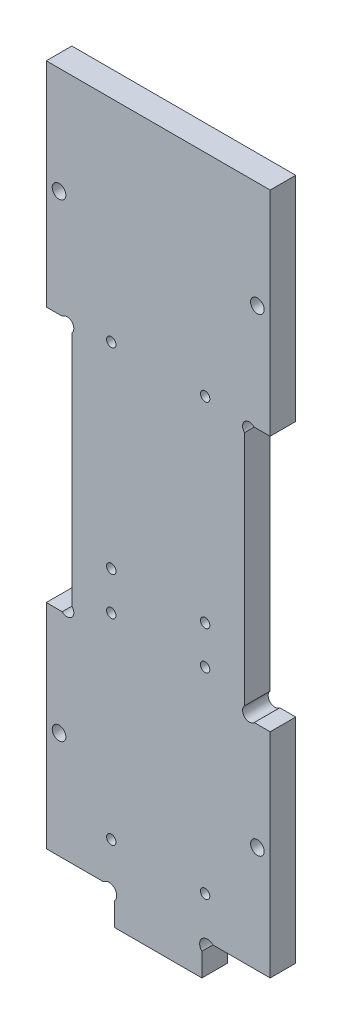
ISO-10303-21;
HEADER;
FILE_DESCRIPTION(('STEP AP214'),'2;1');
FILE_NAME('part.step','',(''),(''),'','','');
FILE_SCHEMA(('AUTOMOTIVE_DESIGN { 1 0 10303 214 1 1 1 1 }'));
ENDSEC;
DATA;
#1=APPLICATION_CONTEXT('core data for automotive mechanical design processes');
#2=APPLICATION_PROTOCOL_DEFINITION('international standard','automotive_design',2000,#1);
#3=PRODUCT_CONTEXT('',#1,'mechanical');
#4=PRODUCT('Part','Part','',(#3));
#5=PRODUCT_RELATED_PRODUCT_CATEGORY('part','',(#4));
#6=PRODUCT_DEFINITION_FORMATION('','',#4);
#7=PRODUCT_DEFINITION_CONTEXT('part definition',#1,'design');
#8=PRODUCT_DEFINITION('design','',#6,#7);
#9=PRODUCT_DEFINITION_SHAPE('','',#8);
#10=(LENGTH_UNIT() NAMED_UNIT(*) SI_UNIT(.MILLI.,.METRE.));
#11=(NAMED_UNIT(*) PLANE_ANGLE_UNIT() SI_UNIT($,.RADIAN.));
#12=(NAMED_UNIT(*) SI_UNIT($,.STERADIAN.) SOLID_ANGLE_UNIT());
#13=UNCERTAINTY_MEASURE_WITH_UNIT(LENGTH_MEASURE(1.E-05),#10,'distance_accuracy_value','');
#14=(GEOMETRIC_REPRESENTATION_CONTEXT(3) GLOBAL_UNCERTAINTY_ASSIGNED_CONTEXT((#13)) GLOBAL_UNIT_ASSIGNED_CONTEXT((#10,
#11,#12)) REPRESENTATION_CONTEXT('',''));
#15=CARTESIAN_POINT('',(0.,0.,0.));
#16=DIRECTION('',(0.,0.,1.));
#17=DIRECTION('',(1.,0.,0.));
#18=AXIS2_PLACEMENT_3D('',#15,#16,#17);
#19=CARTESIAN_POINT('',(47.6313708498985,59.1313708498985,6.));
#20=DIRECTION('',(0.,0.,1.));
#21=DIRECTION('',(1.,0.,0.));
#22=AXIS2_PLACEMENT_3D('',#19,#20,#21);
#23=PLANE('',#22);
#24=CARTESIAN_POINT('',(37.25,72.5,6.));
#25=DIRECTION('',(0.,0.,1.));
#26=DIRECTION('',(-1.,0.,0.));
#27=AXIS2_PLACEMENT_3D('',#24,#25,#26);
#28=CIRCLE('',#27,1.10000000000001);
#29=CARTESIAN_POINT('',(36.15,72.5,6.));
#30=VERTEX_POINT('',#29);
#31=EDGE_CURVE('E442',#30,#30,#28,.T.);
#32=ORIENTED_EDGE('',*,*,#31,.F.);
#33=EDGE_LOOP('',(#32));
#34=FACE_BOUND('',#33,.T.);
#35=CARTESIAN_POINT('',(15.25,118.5,6.));
#36=DIRECTION('',(0.,0.,1.));
#37=DIRECTION('',(-1.,0.,0.));
#38=AXIS2_PLACEMENT_3D('',#35,#36,#37);
#39=CIRCLE('',#38,1.1);
#40=CARTESIAN_POINT('',(14.15,118.5,6.));
#41=VERTEX_POINT('',#40);
#42=EDGE_CURVE('E454',#41,#41,#39,.T.);
#43=ORIENTED_EDGE('',*,*,#42,.F.);
#44=EDGE_LOOP('',(#43));
#45=FACE_BOUND('',#44,.T.);
#46=CARTESIAN_POINT('',(37.25,17.5,6.));
#47=DIRECTION('',(0.,0.,1.));
#48=DIRECTION('',(1.,0.,0.));
#49=AXIS2_PLACEMENT_3D('',#46,#47,#48);
#50=CIRCLE('',#49,1.1);
#51=CARTESIAN_POINT('',(38.35,17.5,6.));
#52=VERTEX_POINT('',#51);
#53=EDGE_CURVE('E466',#52,#52,#50,.T.);
#54=ORIENTED_EDGE('',*,*,#53,.F.);
#55=EDGE_LOOP('',(#54));
#56=FACE_BOUND('',#55,.T.);
#57=CARTESIAN_POINT('',(15.25,63.5,6.));
#58=DIRECTION('',(0.,0.,1.));
#59=DIRECTION('',(1.,0.,0.));
#60=AXIS2_PLACEMENT_3D('',#57,#58,#59);
#61=CIRCLE('',#60,1.1);
#62=CARTESIAN_POINT('',(16.35,63.5,6.));
#63=VERTEX_POINT('',#62);
#64=EDGE_CURVE('E478',#63,#63,#61,.T.);
#65=ORIENTED_EDGE('',*,*,#64,.F.);
#66=EDGE_LOOP('',(#65));
#67=FACE_BOUND('',#66,.T.);
#68=CARTESIAN_POINT('',(2.99999999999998,143.,6.));
#69=DIRECTION('',(0.,0.,1.));
#70=DIRECTION('',(1.,0.,0.));
#71=AXIS2_PLACEMENT_3D('',#68,#69,#70);
#72=CIRCLE('',#71,1.59999999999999);
#73=CARTESIAN_POINT('',(4.59999999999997,143.,6.));
#74=VERTEX_POINT('',#73);
#75=EDGE_CURVE('E490',#74,#74,#72,.T.);
#76=ORIENTED_EDGE('',*,*,#75,.F.);
#77=EDGE_LOOP('',(#76));
#78=FACE_BOUND('',#77,.T.);
#79=CARTESIAN_POINT('',(49.5,33.,6.));
#80=DIRECTION('',(0.,0.,1.));
#81=DIRECTION('',(1.,0.,0.));
#82=AXIS2_PLACEMENT_3D('',#79,#80,#81);
#83=CIRCLE('',#82,1.6);
#84=CARTESIAN_POINT('',(51.1,33.,6.));
#85=VERTEX_POINT('',#84);
#86=EDGE_CURVE('E202',#85,#85,#83,.T.);
#87=ORIENTED_EDGE('',*,*,#86,.F.);
#88=EDGE_LOOP('',(#87));
#89=FACE_BOUND('',#88,.T.);
#90=CARTESIAN_POINT('',(47.6313708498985,59.1313708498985,6.));
#91=DIRECTION('',(0.,0.,-1.));
#92=DIRECTION('',(1.,0.,0.));
#93=AXIS2_PLACEMENT_3D('',#90,#91,#92);
#94=CIRCLE('',#93,1.60000000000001);
#95=CARTESIAN_POINT('',(48.762741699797,58.,6.));
#96=VERTEX_POINT('',#95);
#97=CARTESIAN_POINT('',(46.5,60.262741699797,6.));
#98=VERTEX_POINT('',#97);
#99=EDGE_CURVE('E241',#96,#98,#94,.T.);
#100=ORIENTED_EDGE('',*,*,#99,.T.);
#101=DIRECTION('',(0.,1.,0.));
#102=VECTOR('',#101,1.);
#103=CARTESIAN_POINT('',(46.5,115.737258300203,6.));
#104=LINE('',#103,#102);
#105=CARTESIAN_POINT('',(46.5,115.737258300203,6.));
#106=VERTEX_POINT('',#105);
#107=EDGE_CURVE('E119',#98,#106,#104,.T.);
#108=ORIENTED_EDGE('',*,*,#107,.T.);
#109=CARTESIAN_POINT('',(47.6313708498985,116.868629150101,6.));
#110=DIRECTION('',(0.,0.,-1.));
#111=DIRECTION('',(-1.,0.,0.));
#112=AXIS2_PLACEMENT_3D('',#109,#110,#111);
#113=CIRCLE('',#112,1.60000000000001);
#114=CARTESIAN_POINT('',(48.762741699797,118.,6.));
#115=VERTEX_POINT('',#114);
#116=EDGE_CURVE('E298',#106,#115,#113,.T.);
#117=ORIENTED_EDGE('',*,*,#116,.T.);
#118=DIRECTION('',(1.,0.,0.));
#119=VECTOR('',#118,1.);
#120=CARTESIAN_POINT('',(48.762741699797,118.,6.));
#121=LINE('',#120,#119);
#122=CARTESIAN_POINT('',(52.5,118.,6.));
#123=VERTEX_POINT('',#122);
#124=EDGE_CURVE('E317',#115,#123,#121,.T.);
#125=ORIENTED_EDGE('',*,*,#124,.T.);
#126=DIRECTION('',(0.,1.,0.));
#127=VECTOR('',#126,1.);
#128=CARTESIAN_POINT('',(52.5,118.,6.));
#129=LINE('',#128,#127);
#130=CARTESIAN_POINT('',(52.5,168.,6.));
#131=VERTEX_POINT('',#130);
#132=EDGE_CURVE('E314',#123,#131,#129,.T.);
#133=ORIENTED_EDGE('',*,*,#132,.T.);
#134=DIRECTION('',(-1.,0.,0.));
#135=VECTOR('',#134,1.);
#136=CARTESIAN_POINT('',(0.,168.,6.));
#137=LINE('',#136,#135);
#138=CARTESIAN_POINT('',(0.,168.,6.));
#139=VERTEX_POINT('',#138);
#140=EDGE_CURVE('E316',#131,#139,#137,.T.);
#141=ORIENTED_EDGE('',*,*,#140,.T.);
#142=DIRECTION('',(0.,-1.,0.));
#143=VECTOR('',#142,1.);
#144=CARTESIAN_POINT('',(0.,118.,6.));
#145=LINE('',#144,#143);
#146=CARTESIAN_POINT('',(0.,118.,6.));
#147=VERTEX_POINT('',#146);
#148=EDGE_CURVE('E319',#139,#147,#145,.T.);
#149=ORIENTED_EDGE('',*,*,#148,.T.);
#150=DIRECTION('',(1.,0.,0.));
#151=VECTOR('',#150,1.);
#152=CARTESIAN_POINT('',(3.73725830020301,118.,6.));
#153=LINE('',#152,#151);
#154=CARTESIAN_POINT('',(3.73725830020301,118.,6.));
#155=VERTEX_POINT('',#154);
#156=EDGE_CURVE('E325',#147,#155,#153,.T.);
#157=ORIENTED_EDGE('',*,*,#156,.T.);
#158=CARTESIAN_POINT('',(4.86862915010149,116.868629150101,6.));
#159=DIRECTION('',(0.,0.,-1.));
#160=DIRECTION('',(1.,0.,0.));
#161=AXIS2_PLACEMENT_3D('',#158,#159,#160);
#162=CIRCLE('',#161,1.60000000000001);
#163=CARTESIAN_POINT('',(5.99999999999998,115.737258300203,6.));
#164=VERTEX_POINT('',#163);
#165=EDGE_CURVE('E327',#155,#164,#162,.T.);
#166=ORIENTED_EDGE('',*,*,#165,.T.);
#167=DIRECTION('',(0.,-1.,0.));
#168=VECTOR('',#167,1.);
#169=CARTESIAN_POINT('',(5.99999999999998,115.737258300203,6.));
#170=LINE('',#169,#168);
#171=CARTESIAN_POINT('',(5.99999999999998,60.2627416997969,6.));
#172=VERTEX_POINT('',#171);
#173=EDGE_CURVE('E329',#164,#172,#170,.T.);
#174=ORIENTED_EDGE('',*,*,#173,.T.);
#175=CARTESIAN_POINT('',(4.86862915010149,59.1313708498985,6.));
#176=DIRECTION('',(0.,0.,-1.));
#177=DIRECTION('',(-1.,0.,0.));
#178=AXIS2_PLACEMENT_3D('',#175,#176,#177);
#179=CIRCLE('',#178,1.60000000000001);
#180=CARTESIAN_POINT('',(3.73725830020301,58.,6.));
#181=VERTEX_POINT('',#180);
#182=EDGE_CURVE('E331',#172,#181,#179,.T.);
#183=ORIENTED_EDGE('',*,*,#182,.T.);
#184=DIRECTION('',(-1.,0.,0.));
#185=VECTOR('',#184,1.);
#186=CARTESIAN_POINT('',(3.73725830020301,58.,6.));
#187=LINE('',#186,#185);
#188=CARTESIAN_POINT('',(0.,58.,6.));
#189=VERTEX_POINT('',#188);
#190=EDGE_CURVE('E333',#181,#189,#187,.T.);
#191=ORIENTED_EDGE('',*,*,#190,.T.);
#192=DIRECTION('',(0.,-1.,0.));
#193=VECTOR('',#192,1.);
#194=CARTESIAN_POINT('',(0.,7.99999999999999,6.));
#195=LINE('',#194,#193);
#196=CARTESIAN_POINT('',(0.,7.99999999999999,6.));
#197=VERTEX_POINT('',#196);
#198=EDGE_CURVE('E335',#189,#197,#195,.T.);
#199=ORIENTED_EDGE('',*,*,#198,.T.);
#200=DIRECTION('',(1.,0.,0.));
#201=VECTOR('',#200,1.);
#202=CARTESIAN_POINT('',(13.4327442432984,7.99999999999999,6.));
#203=LINE('',#202,#201);
#204=CARTESIAN_POINT('',(13.4327442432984,7.99999999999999,6.));
#205=VERTEX_POINT('',#204);
#206=EDGE_CURVE('E337',#197,#205,#203,.T.);
#207=ORIENTED_EDGE('',*,*,#206,.T.);
#208=CARTESIAN_POINT('',(14.7163721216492,6.7163721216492,6.));
#209=DIRECTION('',(0.,0.,-1.));
#210=DIRECTION('',(1.,0.,0.));
#211=AXIS2_PLACEMENT_3D('',#208,#209,#210);
#212=CIRCLE('',#211,1.81532395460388);
#213=CARTESIAN_POINT('',(16.,5.43274424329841,6.));
#214=VERTEX_POINT('',#213);
#215=EDGE_CURVE('E339',#205,#214,#212,.T.);
#216=ORIENTED_EDGE('',*,*,#215,.T.);
#217=DIRECTION('',(0.,-1.,0.));
#218=VECTOR('',#217,1.);
#219=CARTESIAN_POINT('',(16.,5.43274424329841,6.));
#220=LINE('',#219,#218);
#221=CARTESIAN_POINT('',(16.,0.,6.));
#222=VERTEX_POINT('',#221);
#223=EDGE_CURVE('E341',#214,#222,#220,.T.);
#224=ORIENTED_EDGE('',*,*,#223,.T.);
#225=DIRECTION('',(1.,0.,0.));
#226=VECTOR('',#225,1.);
#227=CARTESIAN_POINT('',(16.,0.,6.));
#228=LINE('',#227,#226);
#229=CARTESIAN_POINT('',(36.5,0.,6.));
#230=VERTEX_POINT('',#229);
#231=EDGE_CURVE('E343',#222,#230,#228,.T.);
#232=ORIENTED_EDGE('',*,*,#231,.T.);
#233=DIRECTION('',(0.,1.,0.));
#234=VECTOR('',#233,1.);
#235=CARTESIAN_POINT('',(36.5,5.43274424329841,6.));
#236=LINE('',#235,#234);
#237=CARTESIAN_POINT('',(36.5,5.43274424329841,6.));
#238=VERTEX_POINT('',#237);
#239=EDGE_CURVE('E345',#230,#238,#236,.T.);
#240=ORIENTED_EDGE('',*,*,#239,.T.);
#241=CARTESIAN_POINT('',(37.7836278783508,6.7163721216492,6.));
#242=DIRECTION('',(0.,0.,-1.));
#243=DIRECTION('',(-1.,0.,0.));
#244=AXIS2_PLACEMENT_3D('',#241,#242,#243);
#245=CIRCLE('',#244,1.81532395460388);
#246=CARTESIAN_POINT('',(39.0672557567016,7.99999999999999,6.));
#247=VERTEX_POINT('',#246);
#248=EDGE_CURVE('E180',#238,#247,#245,.T.);
#249=ORIENTED_EDGE('',*,*,#248,.T.);
#250=DIRECTION('',(1.,0.,0.));
#251=VECTOR('',#250,1.);
#252=CARTESIAN_POINT('',(39.0672557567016,7.99999999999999,6.));
#253=LINE('',#252,#251);
#254=CARTESIAN_POINT('',(52.5,7.99999999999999,6.));
#255=VERTEX_POINT('',#254);
#256=EDGE_CURVE('E174',#247,#255,#253,.T.);
#257=ORIENTED_EDGE('',*,*,#256,.T.);
#258=DIRECTION('',(0.,1.,0.));
#259=VECTOR('',#258,1.);
#260=CARTESIAN_POINT('',(52.5,58.,6.));
#261=LINE('',#260,#259);
#262=CARTESIAN_POINT('',(52.5,58.,6.));
#263=VERTEX_POINT('',#262);
#264=EDGE_CURVE('E178',#255,#263,#261,.T.);
#265=ORIENTED_EDGE('',*,*,#264,.T.);
#266=DIRECTION('',(-1.,0.,0.));
#267=VECTOR('',#266,1.);
#268=CARTESIAN_POINT('',(48.762741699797,58.,6.));
#269=LINE('',#268,#267);
#270=EDGE_CURVE('E34',#263,#96,#269,.T.);
#271=ORIENTED_EDGE('',*,*,#270,.T.);
#272=EDGE_LOOP('',(#100,#108,#117,#125,#133,#141,#149,#157,#166,#174,#183,#191,#199,#207,#216,
#224,#232,#240,#249,#257,#265,#271));
#273=FACE_BOUND('',#272,.T.);
#274=CARTESIAN_POINT('',(49.5,143.,6.));
#275=DIRECTION('',(0.,0.,1.));
#276=DIRECTION('',(-1.,0.,0.));
#277=AXIS2_PLACEMENT_3D('',#274,#275,#276);
#278=CIRCLE('',#277,1.6);
#279=CARTESIAN_POINT('',(47.9,143.,6.));
#280=VERTEX_POINT('',#279);
#281=EDGE_CURVE('E496',#280,#280,#278,.T.);
#282=ORIENTED_EDGE('',*,*,#281,.F.);
#283=EDGE_LOOP('',(#282));
#284=FACE_BOUND('',#283,.T.);
#285=CARTESIAN_POINT('',(2.99999999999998,33.,6.));
#286=DIRECTION('',(0.,0.,1.));
#287=DIRECTION('',(-1.,0.,0.));
#288=AXIS2_PLACEMENT_3D('',#285,#286,#287);
#289=CIRCLE('',#288,1.6);
#290=CARTESIAN_POINT('',(1.39999999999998,33.,6.));
#291=VERTEX_POINT('',#290);
#292=EDGE_CURVE('E484',#291,#291,#289,.T.);
#293=ORIENTED_EDGE('',*,*,#292,.F.);
#294=EDGE_LOOP('',(#293));
#295=FACE_BOUND('',#294,.T.);
#296=CARTESIAN_POINT('',(37.25,63.5,6.));
#297=DIRECTION('',(0.,0.,1.));
#298=DIRECTION('',(1.,0.,0.));
#299=AXIS2_PLACEMENT_3D('',#296,#297,#298);
#300=CIRCLE('',#299,1.10000000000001);
#301=CARTESIAN_POINT('',(38.35,63.5,6.));
#302=VERTEX_POINT('',#301);
#303=EDGE_CURVE('E472',#302,#302,#300,.T.);
#304=ORIENTED_EDGE('',*,*,#303,.F.);
#305=EDGE_LOOP('',(#304));
#306=FACE_BOUND('',#305,.T.);
#307=CARTESIAN_POINT('',(15.25,17.5,6.));
#308=DIRECTION('',(0.,0.,1.));
#309=DIRECTION('',(1.,0.,0.));
#310=AXIS2_PLACEMENT_3D('',#307,#308,#309);
#311=CIRCLE('',#310,1.1);
#312=CARTESIAN_POINT('',(16.35,17.5,6.));
#313=VERTEX_POINT('',#312);
#314=EDGE_CURVE('E460',#313,#313,#311,.T.);
#315=ORIENTED_EDGE('',*,*,#314,.F.);
#316=EDGE_LOOP('',(#315));
#317=FACE_BOUND('',#316,.T.);
#318=CARTESIAN_POINT('',(37.25,118.5,6.));
#319=DIRECTION('',(0.,0.,1.));
#320=DIRECTION('',(-1.,0.,0.));
#321=AXIS2_PLACEMENT_3D('',#318,#319,#320);
#322=CIRCLE('',#321,1.10000000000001);
#323=CARTESIAN_POINT('',(36.15,118.5,6.));
#324=VERTEX_POINT('',#323);
#325=EDGE_CURVE('E448',#324,#324,#322,.T.);
#326=ORIENTED_EDGE('',*,*,#325,.F.);
#327=EDGE_LOOP('',(#326));
#328=FACE_BOUND('',#327,.T.);
#329=CARTESIAN_POINT('',(15.25,72.5,6.));
#330=DIRECTION('',(0.,0.,1.));
#331=DIRECTION('',(-1.,0.,0.));
#332=AXIS2_PLACEMENT_3D('',#329,#330,#331);
#333=CIRCLE('',#332,1.1);
#334=CARTESIAN_POINT('',(14.15,72.5,6.));
#335=VERTEX_POINT('',#334);
#336=EDGE_CURVE('E433',#335,#335,#333,.T.);
#337=ORIENTED_EDGE('',*,*,#336,.F.);
#338=EDGE_LOOP('',(#337));
#339=FACE_BOUND('',#338,.T.);
#340=ADVANCED_FACE('F17',(#34,#45,#56,#67,#78,#89,#273,#284,#295,#306,#317,#328,#339),#23,.T.);
#341=CARTESIAN_POINT('',(47.6313708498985,59.1313708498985,0.));
#342=DIRECTION('',(0.,0.,1.));
#343=DIRECTION('',(1.,0.,0.));
#344=AXIS2_PLACEMENT_3D('',#341,#342,#343);
#345=PLANE('',#344);
#346=CARTESIAN_POINT('',(37.25,72.5,0.));
#347=DIRECTION('',(0.,0.,1.));
#348=DIRECTION('',(-1.,0.,0.));
#349=AXIS2_PLACEMENT_3D('',#346,#347,#348);
#350=CIRCLE('',#349,1.10000000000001);
#351=CARTESIAN_POINT('',(36.15,72.5,0.));
#352=VERTEX_POINT('',#351);
#353=EDGE_CURVE('E439',#352,#352,#350,.T.);
#354=ORIENTED_EDGE('',*,*,#353,.T.);
#355=EDGE_LOOP('',(#354));
#356=FACE_BOUND('',#355,.T.);
#357=CARTESIAN_POINT('',(15.25,118.5,0.));
#358=DIRECTION('',(0.,0.,1.));
#359=DIRECTION('',(-1.,0.,0.));
#360=AXIS2_PLACEMENT_3D('',#357,#358,#359);
#361=CIRCLE('',#360,1.1);
#362=CARTESIAN_POINT('',(14.15,118.5,0.));
#363=VERTEX_POINT('',#362);
#364=EDGE_CURVE('E451',#363,#363,#361,.T.);
#365=ORIENTED_EDGE('',*,*,#364,.T.);
#366=EDGE_LOOP('',(#365));
#367=FACE_BOUND('',#366,.T.);
#368=CARTESIAN_POINT('',(37.25,17.5,0.));
#369=DIRECTION('',(0.,0.,1.));
#370=DIRECTION('',(1.,0.,0.));
#371=AXIS2_PLACEMENT_3D('',#368,#369,#370);
#372=CIRCLE('',#371,1.1);
#373=CARTESIAN_POINT('',(38.35,17.5,0.));
#374=VERTEX_POINT('',#373);
#375=EDGE_CURVE('E463',#374,#374,#372,.T.);
#376=ORIENTED_EDGE('',*,*,#375,.T.);
#377=EDGE_LOOP('',(#376));
#378=FACE_BOUND('',#377,.T.);
#379=CARTESIAN_POINT('',(15.25,63.5,0.));
#380=DIRECTION('',(0.,0.,1.));
#381=DIRECTION('',(1.,0.,0.));
#382=AXIS2_PLACEMENT_3D('',#379,#380,#381);
#383=CIRCLE('',#382,1.1);
#384=CARTESIAN_POINT('',(16.35,63.5,0.));
#385=VERTEX_POINT('',#384);
#386=EDGE_CURVE('E475',#385,#385,#383,.T.);
#387=ORIENTED_EDGE('',*,*,#386,.T.);
#388=EDGE_LOOP('',(#387));
#389=FACE_BOUND('',#388,.T.);
#390=CARTESIAN_POINT('',(2.99999999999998,143.,0.));
#391=DIRECTION('',(0.,0.,1.));
#392=DIRECTION('',(1.,0.,0.));
#393=AXIS2_PLACEMENT_3D('',#390,#391,#392);
#394=CIRCLE('',#393,1.59999999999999);
#395=CARTESIAN_POINT('',(4.59999999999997,143.,0.));
#396=VERTEX_POINT('',#395);
#397=EDGE_CURVE('E487',#396,#396,#394,.T.);
#398=ORIENTED_EDGE('',*,*,#397,.T.);
#399=EDGE_LOOP('',(#398));
#400=FACE_BOUND('',#399,.T.);
#401=CARTESIAN_POINT('',(49.5,33.,0.));
#402=DIRECTION('',(0.,0.,1.));
#403=DIRECTION('',(1.,0.,0.));
#404=AXIS2_PLACEMENT_3D('',#401,#402,#403);
#405=CIRCLE('',#404,1.6);
#406=CARTESIAN_POINT('',(51.1,33.,0.));
#407=VERTEX_POINT('',#406);
#408=EDGE_CURVE('E499',#407,#407,#405,.T.);
#409=ORIENTED_EDGE('',*,*,#408,.T.);
#410=EDGE_LOOP('',(#409));
#411=FACE_BOUND('',#410,.T.);
#412=CARTESIAN_POINT('',(47.6313708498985,59.1313708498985,0.));
#413=DIRECTION('',(0.,0.,-1.));
#414=DIRECTION('',(1.,0.,0.));
#415=AXIS2_PLACEMENT_3D('',#412,#413,#414);
#416=CIRCLE('',#415,1.60000000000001);
#417=CARTESIAN_POINT('',(48.762741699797,58.,0.));
#418=VERTEX_POINT('',#417);
#419=CARTESIAN_POINT('',(46.5,60.262741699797,0.));
#420=VERTEX_POINT('',#419);
#421=EDGE_CURVE('E198',#418,#420,#416,.T.);
#422=ORIENTED_EDGE('',*,*,#421,.F.);
#423=DIRECTION('',(-1.,0.,0.));
#424=VECTOR('',#423,1.);
#425=CARTESIAN_POINT('',(48.762741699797,58.,0.));
#426=LINE('',#425,#424);
#427=CARTESIAN_POINT('',(52.5,58.,0.));
#428=VERTEX_POINT('',#427);
#429=EDGE_CURVE('E111',#428,#418,#426,.T.);
#430=ORIENTED_EDGE('',*,*,#429,.F.);
#431=DIRECTION('',(0.,1.,0.));
#432=VECTOR('',#431,1.);
#433=CARTESIAN_POINT('',(52.5,58.,0.));
#434=LINE('',#433,#432);
#435=CARTESIAN_POINT('',(52.5,7.99999999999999,0.));
#436=VERTEX_POINT('',#435);
#437=EDGE_CURVE('E105',#436,#428,#434,.T.);
#438=ORIENTED_EDGE('',*,*,#437,.F.);
#439=DIRECTION('',(1.,0.,0.));
#440=VECTOR('',#439,1.);
#441=CARTESIAN_POINT('',(39.0672557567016,7.99999999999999,0.));
#442=LINE('',#441,#440);
#443=CARTESIAN_POINT('',(39.0672557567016,7.99999999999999,0.));
#444=VERTEX_POINT('',#443);
#445=EDGE_CURVE('E188',#444,#436,#442,.T.);
#446=ORIENTED_EDGE('',*,*,#445,.F.);
#447=CARTESIAN_POINT('',(37.7836278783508,6.7163721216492,0.));
#448=DIRECTION('',(0.,0.,-1.));
#449=DIRECTION('',(-1.,0.,0.));
#450=AXIS2_PLACEMENT_3D('',#447,#448,#449);
#451=CIRCLE('',#450,1.81532395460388);
#452=CARTESIAN_POINT('',(36.5,5.43274424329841,0.));
#453=VERTEX_POINT('',#452);
#454=EDGE_CURVE('E236',#453,#444,#451,.T.);
#455=ORIENTED_EDGE('',*,*,#454,.F.);
#456=DIRECTION('',(0.,1.,0.));
#457=VECTOR('',#456,1.);
#458=CARTESIAN_POINT('',(36.5,5.43274424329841,0.));
#459=LINE('',#458,#457);
#460=CARTESIAN_POINT('',(36.5,0.,0.));
#461=VERTEX_POINT('',#460);
#462=EDGE_CURVE('E234',#461,#453,#459,.T.);
#463=ORIENTED_EDGE('',*,*,#462,.F.);
#464=DIRECTION('',(1.,0.,0.));
#465=VECTOR('',#464,1.);
#466=CARTESIAN_POINT('',(16.,0.,0.));
#467=LINE('',#466,#465);
#468=CARTESIAN_POINT('',(16.,0.,0.));
#469=VERTEX_POINT('',#468);
#470=EDGE_CURVE('E232',#469,#461,#467,.T.);
#471=ORIENTED_EDGE('',*,*,#470,.F.);
#472=DIRECTION('',(0.,-1.,0.));
#473=VECTOR('',#472,1.);
#474=CARTESIAN_POINT('',(16.,5.43274424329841,0.));
#475=LINE('',#474,#473);
#476=CARTESIAN_POINT('',(16.,5.43274424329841,0.));
#477=VERTEX_POINT('',#476);
#478=EDGE_CURVE('E230',#477,#469,#475,.T.);
#479=ORIENTED_EDGE('',*,*,#478,.F.);
#480=CARTESIAN_POINT('',(14.7163721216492,6.7163721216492,0.));
#481=DIRECTION('',(0.,0.,-1.));
#482=DIRECTION('',(1.,0.,0.));
#483=AXIS2_PLACEMENT_3D('',#480,#481,#482);
#484=CIRCLE('',#483,1.81532395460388);
#485=CARTESIAN_POINT('',(13.4327442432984,7.99999999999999,0.));
#486=VERTEX_POINT('',#485);
#487=EDGE_CURVE('E228',#486,#477,#484,.T.);
#488=ORIENTED_EDGE('',*,*,#487,.F.);
#489=DIRECTION('',(1.,0.,0.));
#490=VECTOR('',#489,1.);
#491=CARTESIAN_POINT('',(13.4327442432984,7.99999999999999,0.));
#492=LINE('',#491,#490);
#493=CARTESIAN_POINT('',(0.,7.99999999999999,0.));
#494=VERTEX_POINT('',#493);
#495=EDGE_CURVE('E226',#494,#486,#492,.T.);
#496=ORIENTED_EDGE('',*,*,#495,.F.);
#497=DIRECTION('',(0.,-1.,0.));
#498=VECTOR('',#497,1.);
#499=CARTESIAN_POINT('',(0.,7.99999999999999,0.));
#500=LINE('',#499,#498);
#501=CARTESIAN_POINT('',(0.,58.,0.));
#502=VERTEX_POINT('',#501);
#503=EDGE_CURVE('E224',#502,#494,#500,.T.);
#504=ORIENTED_EDGE('',*,*,#503,.F.);
#505=DIRECTION('',(-1.,0.,0.));
#506=VECTOR('',#505,1.);
#507=CARTESIAN_POINT('',(3.73725830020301,58.,0.));
#508=LINE('',#507,#506);
#509=CARTESIAN_POINT('',(3.73725830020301,58.,0.));
#510=VERTEX_POINT('',#509);
#511=EDGE_CURVE('E222',#510,#502,#508,.T.);
#512=ORIENTED_EDGE('',*,*,#511,.F.);
#513=CARTESIAN_POINT('',(4.86862915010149,59.1313708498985,0.));
#514=DIRECTION('',(0.,0.,-1.));
#515=DIRECTION('',(-1.,0.,0.));
#516=AXIS2_PLACEMENT_3D('',#513,#514,#515);
#517=CIRCLE('',#516,1.60000000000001);
#518=CARTESIAN_POINT('',(5.99999999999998,60.2627416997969,0.));
#519=VERTEX_POINT('',#518);
#520=EDGE_CURVE('E220',#519,#510,#517,.T.);
#521=ORIENTED_EDGE('',*,*,#520,.F.);
#522=DIRECTION('',(0.,-1.,0.));
#523=VECTOR('',#522,1.);
#524=CARTESIAN_POINT('',(5.99999999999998,115.737258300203,0.));
#525=LINE('',#524,#523);
#526=CARTESIAN_POINT('',(5.99999999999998,115.737258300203,0.));
#527=VERTEX_POINT('',#526);
#528=EDGE_CURVE('E218',#527,#519,#525,.T.);
#529=ORIENTED_EDGE('',*,*,#528,.F.);
#530=CARTESIAN_POINT('',(4.86862915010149,116.868629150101,0.));
#531=DIRECTION('',(0.,0.,-1.));
#532=DIRECTION('',(1.,0.,0.));
#533=AXIS2_PLACEMENT_3D('',#530,#531,#532);
#534=CIRCLE('',#533,1.60000000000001);
#535=CARTESIAN_POINT('',(3.73725830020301,118.,0.));
#536=VERTEX_POINT('',#535);
#537=EDGE_CURVE('E216',#536,#527,#534,.T.);
#538=ORIENTED_EDGE('',*,*,#537,.F.);
#539=DIRECTION('',(1.,0.,0.));
#540=VECTOR('',#539,1.);
#541=CARTESIAN_POINT('',(3.73725830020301,118.,0.));
#542=LINE('',#541,#540);
#543=CARTESIAN_POINT('',(0.,118.,0.));
#544=VERTEX_POINT('',#543);
#545=EDGE_CURVE('E214',#544,#536,#542,.T.);
#546=ORIENTED_EDGE('',*,*,#545,.F.);
#547=DIRECTION('',(0.,-1.,0.));
#548=VECTOR('',#547,1.);
#549=CARTESIAN_POINT('',(0.,118.,0.));
#550=LINE('',#549,#548);
#551=CARTESIAN_POINT('',(0.,168.,0.));
#552=VERTEX_POINT('',#551);
#553=EDGE_CURVE('E212',#552,#544,#550,.T.);
#554=ORIENTED_EDGE('',*,*,#553,.F.);
#555=DIRECTION('',(-1.,0.,0.));
#556=VECTOR('',#555,1.);
#557=CARTESIAN_POINT('',(0.,168.,0.));
#558=LINE('',#557,#556);
#559=CARTESIAN_POINT('',(52.5,168.,0.));
#560=VERTEX_POINT('',#559);
#561=EDGE_CURVE('E210',#560,#552,#558,.T.);
#562=ORIENTED_EDGE('',*,*,#561,.F.);
#563=DIRECTION('',(0.,1.,0.));
#564=VECTOR('',#563,1.);
#565=CARTESIAN_POINT('',(52.5,118.,0.));
#566=LINE('',#565,#564);
#567=CARTESIAN_POINT('',(52.5,118.,0.));
#568=VERTEX_POINT('',#567);
#569=EDGE_CURVE('E208',#568,#560,#566,.T.);
#570=ORIENTED_EDGE('',*,*,#569,.F.);
#571=DIRECTION('',(1.,0.,0.));
#572=VECTOR('',#571,1.);
#573=CARTESIAN_POINT('',(48.762741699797,118.,0.));
#574=LINE('',#573,#572);
#575=CARTESIAN_POINT('',(48.762741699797,118.,0.));
#576=VERTEX_POINT('',#575);
#577=EDGE_CURVE('E206',#576,#568,#574,.T.);
#578=ORIENTED_EDGE('',*,*,#577,.F.);
#579=CARTESIAN_POINT('',(47.6313708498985,116.868629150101,0.));
#580=DIRECTION('',(0.,0.,-1.));
#581=DIRECTION('',(-1.,0.,0.));
#582=AXIS2_PLACEMENT_3D('',#579,#580,#581);
#583=CIRCLE('',#582,1.60000000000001);
#584=CARTESIAN_POINT('',(46.5,115.737258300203,0.));
#585=VERTEX_POINT('',#584);
#586=EDGE_CURVE('E204',#585,#576,#583,.T.);
#587=ORIENTED_EDGE('',*,*,#586,.F.);
#588=DIRECTION('',(0.,1.,0.));
#589=VECTOR('',#588,1.);
#590=CARTESIAN_POINT('',(46.5,115.737258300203,0.));
#591=LINE('',#590,#589);
#592=EDGE_CURVE('E201',#420,#585,#591,.T.);
#593=ORIENTED_EDGE('',*,*,#592,.F.);
#594=EDGE_LOOP('',(#422,#430,#438,#446,#455,#463,#471,#479,#488,#496,#504,#512,#521,#529,#538,
#546,#554,#562,#570,#578,#587,#593));
#595=FACE_BOUND('',#594,.T.);
#596=CARTESIAN_POINT('',(49.5,143.,0.));
#597=DIRECTION('',(0.,0.,1.));
#598=DIRECTION('',(-1.,0.,0.));
#599=AXIS2_PLACEMENT_3D('',#596,#597,#598);
#600=CIRCLE('',#599,1.6);
#601=CARTESIAN_POINT('',(47.9,143.,0.));
#602=VERTEX_POINT('',#601);
#603=EDGE_CURVE('E493',#602,#602,#600,.T.);
#604=ORIENTED_EDGE('',*,*,#603,.T.);
#605=EDGE_LOOP('',(#604));
#606=FACE_BOUND('',#605,.T.);
#607=CARTESIAN_POINT('',(2.99999999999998,33.,0.));
#608=DIRECTION('',(0.,0.,1.));
#609=DIRECTION('',(-1.,0.,0.));
#610=AXIS2_PLACEMENT_3D('',#607,#608,#609);
#611=CIRCLE('',#610,1.6);
#612=CARTESIAN_POINT('',(1.39999999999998,33.,0.));
#613=VERTEX_POINT('',#612);
#614=EDGE_CURVE('E481',#613,#613,#611,.T.);
#615=ORIENTED_EDGE('',*,*,#614,.T.);
#616=EDGE_LOOP('',(#615));
#617=FACE_BOUND('',#616,.T.);
#618=CARTESIAN_POINT('',(37.25,63.5,0.));
#619=DIRECTION('',(0.,0.,1.));
#620=DIRECTION('',(1.,0.,0.));
#621=AXIS2_PLACEMENT_3D('',#618,#619,#620);
#622=CIRCLE('',#621,1.10000000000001);
#623=CARTESIAN_POINT('',(38.35,63.5,0.));
#624=VERTEX_POINT('',#623);
#625=EDGE_CURVE('E469',#624,#624,#622,.T.);
#626=ORIENTED_EDGE('',*,*,#625,.T.);
#627=EDGE_LOOP('',(#626));
#628=FACE_BOUND('',#627,.T.);
#629=CARTESIAN_POINT('',(15.25,17.5,0.));
#630=DIRECTION('',(0.,0.,1.));
#631=DIRECTION('',(1.,0.,0.));
#632=AXIS2_PLACEMENT_3D('',#629,#630,#631);
#633=CIRCLE('',#632,1.1);
#634=CARTESIAN_POINT('',(16.35,17.5,0.));
#635=VERTEX_POINT('',#634);
#636=EDGE_CURVE('E457',#635,#635,#633,.T.);
#637=ORIENTED_EDGE('',*,*,#636,.T.);
#638=EDGE_LOOP('',(#637));
#639=FACE_BOUND('',#638,.T.);
#640=CARTESIAN_POINT('',(37.25,118.5,0.));
#641=DIRECTION('',(0.,0.,1.));
#642=DIRECTION('',(-1.,0.,0.));
#643=AXIS2_PLACEMENT_3D('',#640,#641,#642);
#644=CIRCLE('',#643,1.10000000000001);
#645=CARTESIAN_POINT('',(36.15,118.5,0.));
#646=VERTEX_POINT('',#645);
#647=EDGE_CURVE('E445',#646,#646,#644,.T.);
#648=ORIENTED_EDGE('',*,*,#647,.T.);
#649=EDGE_LOOP('',(#648));
#650=FACE_BOUND('',#649,.T.);
#651=CARTESIAN_POINT('',(15.25,72.5,0.));
#652=DIRECTION('',(0.,0.,1.));
#653=DIRECTION('',(-1.,0.,0.));
#654=AXIS2_PLACEMENT_3D('',#651,#652,#653);
#655=CIRCLE('',#654,1.1);
#656=CARTESIAN_POINT('',(14.15,72.5,0.));
#657=VERTEX_POINT('',#656);
#658=EDGE_CURVE('E436',#657,#657,#655,.T.);
#659=ORIENTED_EDGE('',*,*,#658,.T.);
#660=EDGE_LOOP('',(#659));
#661=FACE_BOUND('',#660,.T.);
#662=ADVANCED_FACE('F302',(#356,#367,#378,#389,#400,#411,#595,#606,#617,#628,#639,#650,#661),
#345,.F.);
#663=CARTESIAN_POINT('',(47.6313708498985,59.1313708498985,6.));
#664=DIRECTION('',(0.,0.,-1.));
#665=DIRECTION('',(-1.,0.,0.));
#666=AXIS2_PLACEMENT_3D('',#663,#664,#665);
#667=CYLINDRICAL_SURFACE('',#666,1.60000000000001);
#668=ORIENTED_EDGE('',*,*,#421,.T.);
#669=DIRECTION('',(0.,0.,-1.));
#670=VECTOR('',#669,1.);
#671=CARTESIAN_POINT('',(46.5,60.262741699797,6.));
#672=LINE('',#671,#670);
#673=EDGE_CURVE('E11',#98,#420,#672,.T.);
#674=ORIENTED_EDGE('',*,*,#673,.F.);
#675=ORIENTED_EDGE('',*,*,#99,.F.);
#676=DIRECTION('',(0.,0.,-1.));
#677=VECTOR('',#676,1.);
#678=CARTESIAN_POINT('',(48.762741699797,58.,6.));
#679=LINE('',#678,#677);
#680=EDGE_CURVE('E194',#96,#418,#679,.T.);
#681=ORIENTED_EDGE('',*,*,#680,.T.);
#682=EDGE_LOOP('',(#668,#674,#675,#681));
#683=FACE_BOUND('',#682,.T.);
#684=ADVANCED_FACE('F19',(#683),#667,.F.);
#685=CARTESIAN_POINT('',(46.5,115.737258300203,6.));
#686=DIRECTION('',(-1.,0.,0.));
#687=DIRECTION('',(0.,-1.,0.));
#688=AXIS2_PLACEMENT_3D('',#685,#686,#687);
#689=PLANE('',#688);
#690=ORIENTED_EDGE('',*,*,#592,.T.);
#691=DIRECTION('',(0.,0.,-1.));
#692=VECTOR('',#691,1.);
#693=CARTESIAN_POINT('',(46.5,115.737258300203,6.));
#694=LINE('',#693,#692);
#695=EDGE_CURVE('E26',#106,#585,#694,.T.);
#696=ORIENTED_EDGE('',*,*,#695,.F.);
#697=ORIENTED_EDGE('',*,*,#107,.F.);
#698=ORIENTED_EDGE('',*,*,#673,.T.);
#699=EDGE_LOOP('',(#690,#696,#697,#698));
#700=FACE_BOUND('',#699,.T.);
#701=ADVANCED_FACE('F795',(#700),#689,.F.);
#702=CARTESIAN_POINT('',(47.6313708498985,116.868629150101,6.));
#703=DIRECTION('',(0.,0.,-1.));
#704=DIRECTION('',(-1.,0.,0.));
#705=AXIS2_PLACEMENT_3D('',#702,#703,#704);
#706=CYLINDRICAL_SURFACE('',#705,1.60000000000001);
#707=ORIENTED_EDGE('',*,*,#586,.T.);
#708=DIRECTION('',(0.,0.,-1.));
#709=VECTOR('',#708,1.);
#710=CARTESIAN_POINT('',(48.762741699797,118.,6.));
#711=LINE('',#710,#709);
#712=EDGE_CURVE('E290',#115,#576,#711,.T.);
#713=ORIENTED_EDGE('',*,*,#712,.F.);
#714=ORIENTED_EDGE('',*,*,#116,.F.);
#715=ORIENTED_EDGE('',*,*,#695,.T.);
#716=EDGE_LOOP('',(#707,#713,#714,#715));
#717=FACE_BOUND('',#716,.T.);
#718=ADVANCED_FACE('F296',(#717),#706,.F.);
#719=CARTESIAN_POINT('',(48.762741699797,118.,6.));
#720=DIRECTION('',(0.,1.,0.));
#721=DIRECTION('',(0.,0.,1.));
#722=AXIS2_PLACEMENT_3D('',#719,#720,#721);
#723=PLANE('',#722);
#724=ORIENTED_EDGE('',*,*,#577,.T.);
#725=DIRECTION('',(0.,0.,-1.));
#726=VECTOR('',#725,1.);
#727=CARTESIAN_POINT('',(52.5,118.,6.));
#728=LINE('',#727,#726);
#729=EDGE_CURVE('E287',#123,#568,#728,.T.);
#730=ORIENTED_EDGE('',*,*,#729,.F.);
#731=ORIENTED_EDGE('',*,*,#124,.F.);
#732=ORIENTED_EDGE('',*,*,#712,.T.);
#733=EDGE_LOOP('',(#724,#730,#731,#732));
#734=FACE_BOUND('',#733,.T.);
#735=ADVANCED_FACE('F308',(#734),#723,.F.);
#736=CARTESIAN_POINT('',(52.5,118.,6.));
#737=DIRECTION('',(-1.,0.,0.));
#738=DIRECTION('',(0.,-1.,0.));
#739=AXIS2_PLACEMENT_3D('',#736,#737,#738);
#740=PLANE('',#739);
#741=ORIENTED_EDGE('',*,*,#569,.T.);
#742=DIRECTION('',(0.,0.,-1.));
#743=VECTOR('',#742,1.);
#744=CARTESIAN_POINT('',(52.5,168.,6.));
#745=LINE('',#744,#743);
#746=EDGE_CURVE('E284',#131,#560,#745,.T.);
#747=ORIENTED_EDGE('',*,*,#746,.F.);
#748=ORIENTED_EDGE('',*,*,#132,.F.);
#749=ORIENTED_EDGE('',*,*,#729,.T.);
#750=EDGE_LOOP('',(#741,#747,#748,#749));
#751=FACE_BOUND('',#750,.T.);
#752=ADVANCED_FACE('F312',(#751),#740,.F.);
#753=CARTESIAN_POINT('',(0.,168.,6.));
#754=DIRECTION('',(0.,-1.,0.));
#755=DIRECTION('',(0.,0.,-1.));
#756=AXIS2_PLACEMENT_3D('',#753,#754,#755);
#757=PLANE('',#756);
#758=ORIENTED_EDGE('',*,*,#561,.T.);
#759=DIRECTION('',(0.,0.,-1.));
#760=VECTOR('',#759,1.);
#761=CARTESIAN_POINT('',(0.,168.,6.));
#762=LINE('',#761,#760);
#763=EDGE_CURVE('E281',#139,#552,#762,.T.);
#764=ORIENTED_EDGE('',*,*,#763,.F.);
#765=ORIENTED_EDGE('',*,*,#140,.F.);
#766=ORIENTED_EDGE('',*,*,#746,.T.);
#767=EDGE_LOOP('',(#758,#764,#765,#766));
#768=FACE_BOUND('',#767,.T.);
#769=ADVANCED_FACE('F760',(#768),#757,.F.);
#770=CARTESIAN_POINT('',(0.,118.,6.));
#771=DIRECTION('',(1.,0.,0.));
#772=DIRECTION('',(0.,1.,0.));
#773=AXIS2_PLACEMENT_3D('',#770,#771,#772);
#774=PLANE('',#773);
#775=ORIENTED_EDGE('',*,*,#553,.T.);
#776=DIRECTION('',(0.,0.,-1.));
#777=VECTOR('',#776,1.);
#778=CARTESIAN_POINT('',(0.,118.,6.));
#779=LINE('',#778,#777);
#780=EDGE_CURVE('E278',#147,#544,#779,.T.);
#781=ORIENTED_EDGE('',*,*,#780,.F.);
#782=ORIENTED_EDGE('',*,*,#148,.F.);
#783=ORIENTED_EDGE('',*,*,#763,.T.);
#784=EDGE_LOOP('',(#775,#781,#782,#783));
#785=FACE_BOUND('',#784,.T.);
#786=ADVANCED_FACE('F750',(#785),#774,.F.);
#787=CARTESIAN_POINT('',(3.73725830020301,118.,6.));
#788=DIRECTION('',(0.,1.,0.));
#789=DIRECTION('',(0.,0.,1.));
#790=AXIS2_PLACEMENT_3D('',#787,#788,#789);
#791=PLANE('',#790);
#792=ORIENTED_EDGE('',*,*,#545,.T.);
#793=DIRECTION('',(0.,0.,-1.));
#794=VECTOR('',#793,1.);
#795=CARTESIAN_POINT('',(3.73725830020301,118.,6.));
#796=LINE('',#795,#794);
#797=EDGE_CURVE('E275',#155,#536,#796,.T.);
#798=ORIENTED_EDGE('',*,*,#797,.F.);
#799=ORIENTED_EDGE('',*,*,#156,.F.);
#800=ORIENTED_EDGE('',*,*,#780,.T.);
#801=EDGE_LOOP('',(#792,#798,#799,#800));
#802=FACE_BOUND('',#801,.T.);
#803=ADVANCED_FACE('F740',(#802),#791,.F.);
#804=CARTESIAN_POINT('',(4.86862915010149,116.868629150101,6.));
#805=DIRECTION('',(0.,0.,-1.));
#806=DIRECTION('',(-1.,0.,0.));
#807=AXIS2_PLACEMENT_3D('',#804,#805,#806);
#808=CYLINDRICAL_SURFACE('',#807,1.60000000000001);
#809=ORIENTED_EDGE('',*,*,#537,.T.);
#810=DIRECTION('',(0.,0.,-1.));
#811=VECTOR('',#810,1.);
#812=CARTESIAN_POINT('',(5.99999999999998,115.737258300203,6.));
#813=LINE('',#812,#811);
#814=EDGE_CURVE('E272',#164,#527,#813,.T.);
#815=ORIENTED_EDGE('',*,*,#814,.F.);
#816=ORIENTED_EDGE('',*,*,#165,.F.);
#817=ORIENTED_EDGE('',*,*,#797,.T.);
#818=EDGE_LOOP('',(#809,#815,#816,#817));
#819=FACE_BOUND('',#818,.T.);
#820=ADVANCED_FACE('F730',(#819),#808,.F.);
#821=CARTESIAN_POINT('',(5.99999999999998,115.737258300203,6.));
#822=DIRECTION('',(1.,0.,0.));
#823=DIRECTION('',(0.,0.,-1.));
#824=AXIS2_PLACEMENT_3D('',#821,#822,#823);
#825=PLANE('',#824);
#826=ORIENTED_EDGE('',*,*,#528,.T.);
#827=DIRECTION('',(0.,0.,-1.));
#828=VECTOR('',#827,1.);
#829=CARTESIAN_POINT('',(5.99999999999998,60.2627416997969,6.));
#830=LINE('',#829,#828);
#831=EDGE_CURVE('E269',#172,#519,#830,.T.);
#832=ORIENTED_EDGE('',*,*,#831,.F.);
#833=ORIENTED_EDGE('',*,*,#173,.F.);
#834=ORIENTED_EDGE('',*,*,#814,.T.);
#835=EDGE_LOOP('',(#826,#832,#833,#834));
#836=FACE_BOUND('',#835,.T.);
#837=ADVANCED_FACE('F720',(#836),#825,.F.);
#838=CARTESIAN_POINT('',(4.86862915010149,59.1313708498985,6.));
#839=DIRECTION('',(0.,0.,-1.));
#840=DIRECTION('',(-1.,0.,0.));
#841=AXIS2_PLACEMENT_3D('',#838,#839,#840);
#842=CYLINDRICAL_SURFACE('',#841,1.60000000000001);
#843=ORIENTED_EDGE('',*,*,#520,.T.);
#844=DIRECTION('',(0.,0.,-1.));
#845=VECTOR('',#844,1.);
#846=CARTESIAN_POINT('',(3.73725830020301,58.,6.));
#847=LINE('',#846,#845);
#848=EDGE_CURVE('E266',#181,#510,#847,.T.);
#849=ORIENTED_EDGE('',*,*,#848,.F.);
#850=ORIENTED_EDGE('',*,*,#182,.F.);
#851=ORIENTED_EDGE('',*,*,#831,.T.);
#852=EDGE_LOOP('',(#843,#849,#850,#851));
#853=FACE_BOUND('',#852,.T.);
#854=ADVANCED_FACE('F710',(#853),#842,.F.);
#855=CARTESIAN_POINT('',(3.73725830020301,58.,6.));
#856=DIRECTION('',(0.,-1.,0.));
#857=DIRECTION('',(0.,0.,-1.));
#858=AXIS2_PLACEMENT_3D('',#855,#856,#857);
#859=PLANE('',#858);
#860=ORIENTED_EDGE('',*,*,#511,.T.);
#861=DIRECTION('',(0.,0.,-1.));
#862=VECTOR('',#861,1.);
#863=CARTESIAN_POINT('',(0.,58.,6.));
#864=LINE('',#863,#862);
#865=EDGE_CURVE('E263',#189,#502,#864,.T.);
#866=ORIENTED_EDGE('',*,*,#865,.F.);
#867=ORIENTED_EDGE('',*,*,#190,.F.);
#868=ORIENTED_EDGE('',*,*,#848,.T.);
#869=EDGE_LOOP('',(#860,#866,#867,#868));
#870=FACE_BOUND('',#869,.T.);
#871=ADVANCED_FACE('F700',(#870),#859,.F.);
#872=CARTESIAN_POINT('',(0.,7.99999999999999,6.));
#873=DIRECTION('',(1.,0.,0.));
#874=DIRECTION('',(0.,1.,0.));
#875=AXIS2_PLACEMENT_3D('',#872,#873,#874);
#876=PLANE('',#875);
#877=ORIENTED_EDGE('',*,*,#503,.T.);
#878=DIRECTION('',(0.,0.,-1.));
#879=VECTOR('',#878,1.);
#880=CARTESIAN_POINT('',(0.,7.99999999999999,6.));
#881=LINE('',#880,#879);
#882=EDGE_CURVE('E260',#197,#494,#881,.T.);
#883=ORIENTED_EDGE('',*,*,#882,.F.);
#884=ORIENTED_EDGE('',*,*,#198,.F.);
#885=ORIENTED_EDGE('',*,*,#865,.T.);
#886=EDGE_LOOP('',(#877,#883,#884,#885));
#887=FACE_BOUND('',#886,.T.);
#888=ADVANCED_FACE('F690',(#887),#876,.F.);
#889=CARTESIAN_POINT('',(13.4327442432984,7.99999999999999,6.));
#890=DIRECTION('',(0.,1.,0.));
#891=DIRECTION('',(0.,0.,1.));
#892=AXIS2_PLACEMENT_3D('',#889,#890,#891);
#893=PLANE('',#892);
#894=ORIENTED_EDGE('',*,*,#495,.T.);
#895=DIRECTION('',(0.,0.,-1.));
#896=VECTOR('',#895,1.);
#897=CARTESIAN_POINT('',(13.4327442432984,7.99999999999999,6.));
#898=LINE('',#897,#896);
#899=EDGE_CURVE('E257',#205,#486,#898,.T.);
#900=ORIENTED_EDGE('',*,*,#899,.F.);
#901=ORIENTED_EDGE('',*,*,#206,.F.);
#902=ORIENTED_EDGE('',*,*,#882,.T.);
#903=EDGE_LOOP('',(#894,#900,#901,#902));
#904=FACE_BOUND('',#903,.T.);
#905=ADVANCED_FACE('F680',(#904),#893,.F.);
#906=CARTESIAN_POINT('',(14.7163721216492,6.7163721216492,6.));
#907=DIRECTION('',(0.,0.,-1.));
#908=DIRECTION('',(-1.,0.,0.));
#909=AXIS2_PLACEMENT_3D('',#906,#907,#908);
#910=CYLINDRICAL_SURFACE('',#909,1.81532395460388);
#911=ORIENTED_EDGE('',*,*,#487,.T.);
#912=DIRECTION('',(0.,0.,-1.));
#913=VECTOR('',#912,1.);
#914=CARTESIAN_POINT('',(16.,5.43274424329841,6.));
#915=LINE('',#914,#913);
#916=EDGE_CURVE('E254',#214,#477,#915,.T.);
#917=ORIENTED_EDGE('',*,*,#916,.F.);
#918=ORIENTED_EDGE('',*,*,#215,.F.);
#919=ORIENTED_EDGE('',*,*,#899,.T.);
#920=EDGE_LOOP('',(#911,#917,#918,#919));
#921=FACE_BOUND('',#920,.T.);
#922=ADVANCED_FACE('F670',(#921),#910,.F.);
#923=CARTESIAN_POINT('',(16.,5.43274424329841,6.));
#924=DIRECTION('',(1.,0.,0.));
#925=DIRECTION('',(0.,0.,-1.));
#926=AXIS2_PLACEMENT_3D('',#923,#924,#925);
#927=PLANE('',#926);
#928=ORIENTED_EDGE('',*,*,#478,.T.);
#929=DIRECTION('',(0.,0.,-1.));
#930=VECTOR('',#929,1.);
#931=CARTESIAN_POINT('',(16.,0.,6.));
#932=LINE('',#931,#930);
#933=EDGE_CURVE('E251',#222,#469,#932,.T.);
#934=ORIENTED_EDGE('',*,*,#933,.F.);
#935=ORIENTED_EDGE('',*,*,#223,.F.);
#936=ORIENTED_EDGE('',*,*,#916,.T.);
#937=EDGE_LOOP('',(#928,#934,#935,#936));
#938=FACE_BOUND('',#937,.T.);
#939=ADVANCED_FACE('F660',(#938),#927,.F.);
#940=CARTESIAN_POINT('',(16.,0.,6.));
#941=DIRECTION('',(0.,1.,0.));
#942=DIRECTION('',(0.,0.,1.));
#943=AXIS2_PLACEMENT_3D('',#940,#941,#942);
#944=PLANE('',#943);
#945=ORIENTED_EDGE('',*,*,#470,.T.);
#946=DIRECTION('',(0.,0.,-1.));
#947=VECTOR('',#946,1.);
#948=CARTESIAN_POINT('',(36.5,0.,6.));
#949=LINE('',#948,#947);
#950=EDGE_CURVE('E248',#230,#461,#949,.T.);
#951=ORIENTED_EDGE('',*,*,#950,.F.);
#952=ORIENTED_EDGE('',*,*,#231,.F.);
#953=ORIENTED_EDGE('',*,*,#933,.T.);
#954=EDGE_LOOP('',(#945,#951,#952,#953));
#955=FACE_BOUND('',#954,.T.);
#956=ADVANCED_FACE('F651',(#955),#944,.F.);
#957=CARTESIAN_POINT('',(36.5,5.43274424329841,6.));
#958=DIRECTION('',(-1.,0.,0.));
#959=DIRECTION('',(0.,0.,1.));
#960=AXIS2_PLACEMENT_3D('',#957,#958,#959);
#961=PLANE('',#960);
#962=ORIENTED_EDGE('',*,*,#462,.T.);
#963=DIRECTION('',(0.,0.,-1.));
#964=VECTOR('',#963,1.);
#965=CARTESIAN_POINT('',(36.5,5.43274424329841,6.));
#966=LINE('',#965,#964);
#967=EDGE_CURVE('E245',#238,#453,#966,.T.);
#968=ORIENTED_EDGE('',*,*,#967,.F.);
#969=ORIENTED_EDGE('',*,*,#239,.F.);
#970=ORIENTED_EDGE('',*,*,#950,.T.);
#971=EDGE_LOOP('',(#962,#968,#969,#970));
#972=FACE_BOUND('',#971,.T.);
#973=ADVANCED_FACE('F351',(#972),#961,.F.);
#974=CARTESIAN_POINT('',(37.7836278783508,6.7163721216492,6.));
#975=DIRECTION('',(0.,0.,-1.));
#976=DIRECTION('',(-1.,0.,0.));
#977=AXIS2_PLACEMENT_3D('',#974,#975,#976);
#978=CYLINDRICAL_SURFACE('',#977,1.81532395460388);
#979=ORIENTED_EDGE('',*,*,#454,.T.);
#980=DIRECTION('',(0.,0.,-1.));
#981=VECTOR('',#980,1.);
#982=CARTESIAN_POINT('',(39.0672557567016,7.99999999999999,6.));
#983=LINE('',#982,#981);
#984=EDGE_CURVE('E189',#247,#444,#983,.T.);
#985=ORIENTED_EDGE('',*,*,#984,.F.);
#986=ORIENTED_EDGE('',*,*,#248,.F.);
#987=ORIENTED_EDGE('',*,*,#967,.T.);
#988=EDGE_LOOP('',(#979,#985,#986,#987));
#989=FACE_BOUND('',#988,.T.);
#990=ADVANCED_FACE('F355',(#989),#978,.F.);
#991=CARTESIAN_POINT('',(39.0672557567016,7.99999999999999,6.));
#992=DIRECTION('',(0.,1.,0.));
#993=DIRECTION('',(0.,0.,1.));
#994=AXIS2_PLACEMENT_3D('',#991,#992,#993);
#995=PLANE('',#994);
#996=ORIENTED_EDGE('',*,*,#445,.T.);
#997=DIRECTION('',(0.,0.,-1.));
#998=VECTOR('',#997,1.);
#999=CARTESIAN_POINT('',(52.5,7.99999999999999,6.));
#1000=LINE('',#999,#998);
#1001=EDGE_CURVE('E185',#255,#436,#1000,.T.);
#1002=ORIENTED_EDGE('',*,*,#1001,.F.);
#1003=ORIENTED_EDGE('',*,*,#256,.F.);
#1004=ORIENTED_EDGE('',*,*,#984,.T.);
#1005=EDGE_LOOP('',(#996,#1002,#1003,#1004));
#1006=FACE_BOUND('',#1005,.T.);
#1007=ADVANCED_FACE('F186',(#1006),#995,.F.);
#1008=CARTESIAN_POINT('',(52.5,58.,6.));
#1009=DIRECTION('',(-1.,0.,0.));
#1010=DIRECTION('',(0.,-1.,0.));
#1011=AXIS2_PLACEMENT_3D('',#1008,#1009,#1010);
#1012=PLANE('',#1011);
#1013=ORIENTED_EDGE('',*,*,#437,.T.);
#1014=DIRECTION('',(0.,0.,-1.));
#1015=VECTOR('',#1014,1.);
#1016=CARTESIAN_POINT('',(52.5,58.,6.));
#1017=LINE('',#1016,#1015);
#1018=EDGE_CURVE('E190',#263,#428,#1017,.T.);
#1019=ORIENTED_EDGE('',*,*,#1018,.F.);
#1020=ORIENTED_EDGE('',*,*,#264,.F.);
#1021=ORIENTED_EDGE('',*,*,#1001,.T.);
#1022=EDGE_LOOP('',(#1013,#1019,#1020,#1021));
#1023=FACE_BOUND('',#1022,.T.);
#1024=ADVANCED_FACE('F192',(#1023),#1012,.F.);
#1025=CARTESIAN_POINT('',(48.762741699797,58.,6.));
#1026=DIRECTION('',(0.,-1.,0.));
#1027=DIRECTION('',(0.,0.,-1.));
#1028=AXIS2_PLACEMENT_3D('',#1025,#1026,#1027);
#1029=PLANE('',#1028);
#1030=ORIENTED_EDGE('',*,*,#429,.T.);
#1031=ORIENTED_EDGE('',*,*,#680,.F.);
#1032=ORIENTED_EDGE('',*,*,#270,.F.);
#1033=ORIENTED_EDGE('',*,*,#1018,.T.);
#1034=EDGE_LOOP('',(#1030,#1031,#1032,#1033));
#1035=FACE_BOUND('',#1034,.T.);
#1036=ADVANCED_FACE('F359',(#1035),#1029,.F.);
#1037=CARTESIAN_POINT('',(49.5,33.,6.));
#1038=DIRECTION('',(0.,0.,-1.));
#1039=DIRECTION('',(-1.,0.,0.));
#1040=AXIS2_PLACEMENT_3D('',#1037,#1038,#1039);
#1041=CYLINDRICAL_SURFACE('',#1040,1.6);
#1042=ORIENTED_EDGE('',*,*,#86,.T.);
#1043=EDGE_LOOP('',(#1042));
#1044=FACE_BOUND('',#1043,.T.);
#1045=ORIENTED_EDGE('',*,*,#408,.F.);
#1046=EDGE_LOOP('',(#1045));
#1047=FACE_BOUND('',#1046,.T.);
#1048=ADVANCED_FACE('F361',(#1044,#1047),#1041,.F.);
#1049=CARTESIAN_POINT('',(49.5,143.,6.));
#1050=DIRECTION('',(0.,0.,-1.));
#1051=DIRECTION('',(-1.,0.,0.));
#1052=AXIS2_PLACEMENT_3D('',#1049,#1050,#1051);
#1053=CYLINDRICAL_SURFACE('',#1052,1.6);
#1054=ORIENTED_EDGE('',*,*,#281,.T.);
#1055=EDGE_LOOP('',(#1054));
#1056=FACE_BOUND('',#1055,.T.);
#1057=ORIENTED_EDGE('',*,*,#603,.F.);
#1058=EDGE_LOOP('',(#1057));
#1059=FACE_BOUND('',#1058,.T.);
#1060=ADVANCED_FACE('F369',(#1056,#1059),#1053,.F.);
#1061=CARTESIAN_POINT('',(2.99999999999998,143.,6.));
#1062=DIRECTION('',(0.,0.,-1.));
#1063=DIRECTION('',(-1.,0.,0.));
#1064=AXIS2_PLACEMENT_3D('',#1061,#1062,#1063);
#1065=CYLINDRICAL_SURFACE('',#1064,1.59999999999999);
#1066=ORIENTED_EDGE('',*,*,#75,.T.);
#1067=EDGE_LOOP('',(#1066));
#1068=FACE_BOUND('',#1067,.T.);
#1069=ORIENTED_EDGE('',*,*,#397,.F.);
#1070=EDGE_LOOP('',(#1069));
#1071=FACE_BOUND('',#1070,.T.);
#1072=ADVANCED_FACE('F387',(#1068,#1071),#1065,.F.);
#1073=CARTESIAN_POINT('',(2.99999999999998,33.,6.));
#1074=DIRECTION('',(0.,0.,-1.));
#1075=DIRECTION('',(-1.,0.,0.));
#1076=AXIS2_PLACEMENT_3D('',#1073,#1074,#1075);
#1077=CYLINDRICAL_SURFACE('',#1076,1.6);
#1078=ORIENTED_EDGE('',*,*,#292,.T.);
#1079=EDGE_LOOP('',(#1078));
#1080=FACE_BOUND('',#1079,.T.);
#1081=ORIENTED_EDGE('',*,*,#614,.F.);
#1082=EDGE_LOOP('',(#1081));
#1083=FACE_BOUND('',#1082,.T.);
#1084=ADVANCED_FACE('F391',(#1080,#1083),#1077,.F.);
#1085=CARTESIAN_POINT('',(15.25,63.5,6.));
#1086=DIRECTION('',(0.,0.,-1.));
#1087=DIRECTION('',(-1.,0.,0.));
#1088=AXIS2_PLACEMENT_3D('',#1085,#1086,#1087);
#1089=CYLINDRICAL_SURFACE('',#1088,1.1);
#1090=ORIENTED_EDGE('',*,*,#64,.T.);
#1091=EDGE_LOOP('',(#1090));
#1092=FACE_BOUND('',#1091,.T.);
#1093=ORIENTED_EDGE('',*,*,#386,.F.);
#1094=EDGE_LOOP('',(#1093));
#1095=FACE_BOUND('',#1094,.T.);
#1096=ADVANCED_FACE('F395',(#1092,#1095),#1089,.F.);
#1097=CARTESIAN_POINT('',(37.25,63.5,6.));
#1098=DIRECTION('',(0.,0.,-1.));
#1099=DIRECTION('',(-1.,0.,0.));
#1100=AXIS2_PLACEMENT_3D('',#1097,#1098,#1099);
#1101=CYLINDRICAL_SURFACE('',#1100,1.10000000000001);
#1102=ORIENTED_EDGE('',*,*,#303,.T.);
#1103=EDGE_LOOP('',(#1102));
#1104=FACE_BOUND('',#1103,.T.);
#1105=ORIENTED_EDGE('',*,*,#625,.F.);
#1106=EDGE_LOOP('',(#1105));
#1107=FACE_BOUND('',#1106,.T.);
#1108=ADVANCED_FACE('F399',(#1104,#1107),#1101,.F.);
#1109=CARTESIAN_POINT('',(37.25,17.5,6.));
#1110=DIRECTION('',(0.,0.,-1.));
#1111=DIRECTION('',(-1.,0.,0.));
#1112=AXIS2_PLACEMENT_3D('',#1109,#1110,#1111);
#1113=CYLINDRICAL_SURFACE('',#1112,1.1);
#1114=ORIENTED_EDGE('',*,*,#53,.T.);
#1115=EDGE_LOOP('',(#1114));
#1116=FACE_BOUND('',#1115,.T.);
#1117=ORIENTED_EDGE('',*,*,#375,.F.);
#1118=EDGE_LOOP('',(#1117));
#1119=FACE_BOUND('',#1118,.T.);
#1120=ADVANCED_FACE('F403',(#1116,#1119),#1113,.F.);
#1121=CARTESIAN_POINT('',(15.25,17.5,6.));
#1122=DIRECTION('',(0.,0.,-1.));
#1123=DIRECTION('',(-1.,0.,0.));
#1124=AXIS2_PLACEMENT_3D('',#1121,#1122,#1123);
#1125=CYLINDRICAL_SURFACE('',#1124,1.1);
#1126=ORIENTED_EDGE('',*,*,#314,.T.);
#1127=EDGE_LOOP('',(#1126));
#1128=FACE_BOUND('',#1127,.T.);
#1129=ORIENTED_EDGE('',*,*,#636,.F.);
#1130=EDGE_LOOP('',(#1129));
#1131=FACE_BOUND('',#1130,.T.);
#1132=ADVANCED_FACE('F407',(#1128,#1131),#1125,.F.);
#1133=CARTESIAN_POINT('',(15.25,118.5,6.));
#1134=DIRECTION('',(0.,0.,-1.));
#1135=DIRECTION('',(-1.,0.,0.));
#1136=AXIS2_PLACEMENT_3D('',#1133,#1134,#1135);
#1137=CYLINDRICAL_SURFACE('',#1136,1.1);
#1138=ORIENTED_EDGE('',*,*,#42,.T.);
#1139=EDGE_LOOP('',(#1138));
#1140=FACE_BOUND('',#1139,.T.);
#1141=ORIENTED_EDGE('',*,*,#364,.F.);
#1142=EDGE_LOOP('',(#1141));
#1143=FACE_BOUND('',#1142,.T.);
#1144=ADVANCED_FACE('F411',(#1140,#1143),#1137,.F.);
#1145=CARTESIAN_POINT('',(37.25,118.5,6.));
#1146=DIRECTION('',(0.,0.,-1.));
#1147=DIRECTION('',(-1.,0.,0.));
#1148=AXIS2_PLACEMENT_3D('',#1145,#1146,#1147);
#1149=CYLINDRICAL_SURFACE('',#1148,1.10000000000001);
#1150=ORIENTED_EDGE('',*,*,#325,.T.);
#1151=EDGE_LOOP('',(#1150));
#1152=FACE_BOUND('',#1151,.T.);
#1153=ORIENTED_EDGE('',*,*,#647,.F.);
#1154=EDGE_LOOP('',(#1153));
#1155=FACE_BOUND('',#1154,.T.);
#1156=ADVANCED_FACE('F415',(#1152,#1155),#1149,.F.);
#1157=CARTESIAN_POINT('',(37.25,72.5,6.));
#1158=DIRECTION('',(0.,0.,-1.));
#1159=DIRECTION('',(-1.,0.,0.));
#1160=AXIS2_PLACEMENT_3D('',#1157,#1158,#1159);
#1161=CYLINDRICAL_SURFACE('',#1160,1.10000000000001);
#1162=ORIENTED_EDGE('',*,*,#31,.T.);
#1163=EDGE_LOOP('',(#1162));
#1164=FACE_BOUND('',#1163,.T.);
#1165=ORIENTED_EDGE('',*,*,#353,.F.);
#1166=EDGE_LOOP('',(#1165));
#1167=FACE_BOUND('',#1166,.T.);
#1168=ADVANCED_FACE('F419',(#1164,#1167),#1161,.F.);
#1169=CARTESIAN_POINT('',(15.25,72.5,6.));
#1170=DIRECTION('',(0.,0.,-1.));
#1171=DIRECTION('',(-1.,0.,0.));
#1172=AXIS2_PLACEMENT_3D('',#1169,#1170,#1171);
#1173=CYLINDRICAL_SURFACE('',#1172,1.1);
#1174=ORIENTED_EDGE('',*,*,#336,.T.);
#1175=EDGE_LOOP('',(#1174));
#1176=FACE_BOUND('',#1175,.T.);
#1177=ORIENTED_EDGE('',*,*,#658,.F.);
#1178=EDGE_LOOP('',(#1177));
#1179=FACE_BOUND('',#1178,.T.);
#1180=ADVANCED_FACE('F423',(#1176,#1179),#1173,.F.);
#1181=CLOSED_SHELL('',(#340,#662,#684,#701,#718,#735,#752,#769,#786,#803,#820,#837,#854,#871,
#888,#905,#922,#939,#956,#973,#990,#1007,#1024,#1036,#1048,#1060,#1072,#1084,#1096,#1108,#1120,
#1132,#1144,#1156,#1168,#1180));
#1182=MANIFOLD_SOLID_BREP('B1',#1181);
#1183=ADVANCED_BREP_SHAPE_REPRESENTATION('',(#18,#1182),#14);
#1184=SHAPE_DEFINITION_REPRESENTATION(#9,#1183);
ENDSEC;
END-ISO-10303-21;
